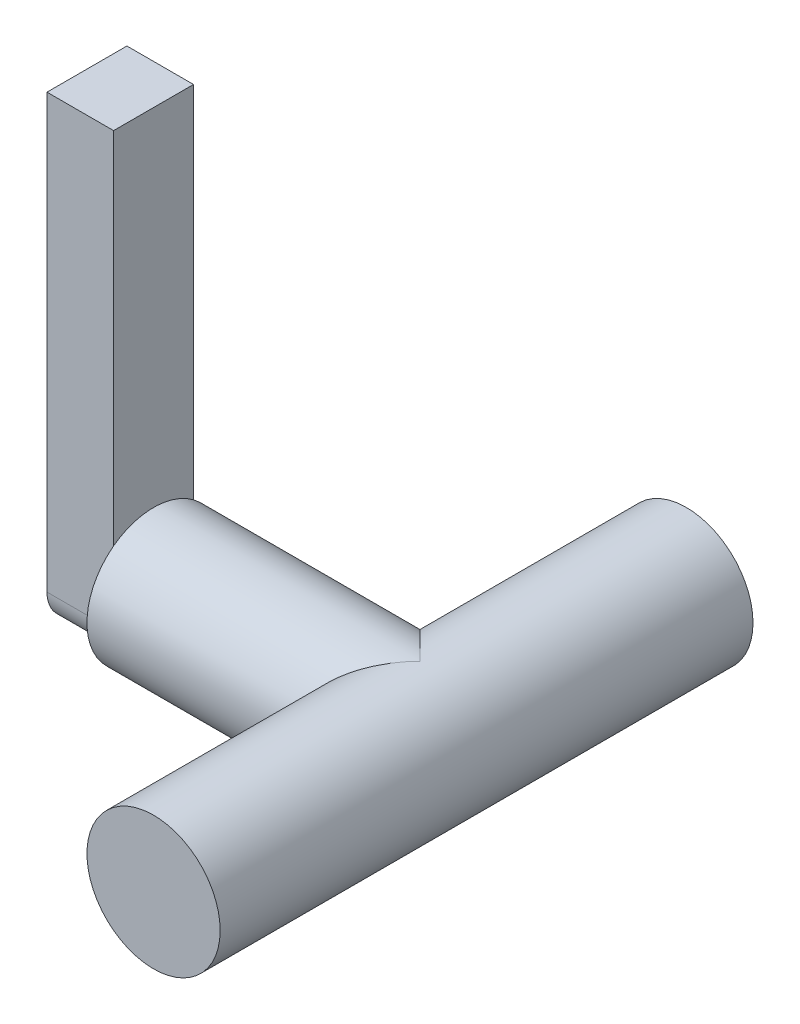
ISO-10303-21;
HEADER;
FILE_DESCRIPTION(('STEP AP214'),'2;1');
FILE_NAME('part.step','',(''),(''),'','','');
FILE_SCHEMA(('AUTOMOTIVE_DESIGN { 1 0 10303 214 1 1 1 1 }'));
ENDSEC;
DATA;
#1=APPLICATION_CONTEXT('core data for automotive mechanical design processes');
#2=APPLICATION_PROTOCOL_DEFINITION('international standard','automotive_design',2000,#1);
#3=PRODUCT_CONTEXT('',#1,'mechanical');
#4=PRODUCT('Part','Part','',(#3));
#5=PRODUCT_RELATED_PRODUCT_CATEGORY('part','',(#4));
#6=PRODUCT_DEFINITION_FORMATION('','',#4);
#7=PRODUCT_DEFINITION_CONTEXT('part definition',#1,'design');
#8=PRODUCT_DEFINITION('design','',#6,#7);
#9=PRODUCT_DEFINITION_SHAPE('','',#8);
#10=(LENGTH_UNIT() NAMED_UNIT(*) SI_UNIT(.MILLI.,.METRE.));
#11=(NAMED_UNIT(*) PLANE_ANGLE_UNIT() SI_UNIT($,.RADIAN.));
#12=(NAMED_UNIT(*) SI_UNIT($,.STERADIAN.) SOLID_ANGLE_UNIT());
#13=UNCERTAINTY_MEASURE_WITH_UNIT(LENGTH_MEASURE(1.E-05),#10,'distance_accuracy_value','');
#14=(GEOMETRIC_REPRESENTATION_CONTEXT(3) GLOBAL_UNCERTAINTY_ASSIGNED_CONTEXT((#13)) GLOBAL_UNIT_ASSIGNED_CONTEXT((#10,
#11,#12)) REPRESENTATION_CONTEXT('',''));
#15=CARTESIAN_POINT('',(0.,0.,0.));
#16=DIRECTION('',(0.,0.,1.));
#17=DIRECTION('',(1.,0.,0.));
#18=AXIS2_PLACEMENT_3D('',#15,#16,#17);
#19=CARTESIAN_POINT('',(-82.55,50.8,25.4));
#20=DIRECTION('',(1.,0.,0.));
#21=DIRECTION('',(0.,0.,-1.));
#22=AXIS2_PLACEMENT_3D('',#19,#20,#21);
#23=PLANE('',#22);
#24=DIRECTION('',(0.,1.,0.));
#25=VECTOR('',#24,1.);
#26=CARTESIAN_POINT('',(-82.55,45.72,29.21));
#27=LINE('',#26,#25);
#28=CARTESIAN_POINT('',(-82.55,48.895,29.21));
#29=VERTEX_POINT('',#28);
#30=CARTESIAN_POINT('',(-82.55,55.88,29.21));
#31=VERTEX_POINT('',#30);
#32=EDGE_CURVE('E136',#29,#31,#27,.T.);
#33=ORIENTED_EDGE('',*,*,#32,.F.);
#34=CARTESIAN_POINT('',(-82.55,48.895,26.035));
#35=DIRECTION('',(1.,0.,0.));
#36=DIRECTION('',(0.,0.,-1.));
#37=AXIS2_PLACEMENT_3D('',#34,#35,#36);
#38=CIRCLE('',#37,3.175);
#39=CARTESIAN_POINT('',(-82.55,45.72,26.035));
#40=VERTEX_POINT('',#39);
#41=EDGE_CURVE('E39',#29,#40,#38,.T.);
#42=ORIENTED_EDGE('',*,*,#41,.T.);
#43=DIRECTION('',(0.,0.,1.));
#44=VECTOR('',#43,1.);
#45=CARTESIAN_POINT('',(-82.55,45.72,21.59));
#46=LINE('',#45,#44);
#47=CARTESIAN_POINT('',(-82.55,45.72,24.765));
#48=VERTEX_POINT('',#47);
#49=EDGE_CURVE('E53',#48,#40,#46,.T.);
#50=ORIENTED_EDGE('',*,*,#49,.F.);
#51=CARTESIAN_POINT('',(-82.55,48.895,24.765));
#52=DIRECTION('',(1.,0.,0.));
#53=DIRECTION('',(0.,0.,-1.));
#54=AXIS2_PLACEMENT_3D('',#51,#52,#53);
#55=CIRCLE('',#54,3.175);
#56=CARTESIAN_POINT('',(-82.55,48.895,21.59));
#57=VERTEX_POINT('',#56);
#58=EDGE_CURVE('E11',#48,#57,#55,.T.);
#59=ORIENTED_EDGE('',*,*,#58,.T.);
#60=DIRECTION('',(0.,-1.,0.));
#61=VECTOR('',#60,1.);
#62=CARTESIAN_POINT('',(-82.55,45.72,21.59));
#63=LINE('',#62,#61);
#64=CARTESIAN_POINT('',(-82.55,55.88,21.59));
#65=VERTEX_POINT('',#64);
#66=EDGE_CURVE('E46',#65,#57,#63,.T.);
#67=ORIENTED_EDGE('',*,*,#66,.F.);
#68=CARTESIAN_POINT('',(-82.55,50.8,25.4));
#69=DIRECTION('',(1.,0.,0.));
#70=DIRECTION('',(0.,0.,-1.));
#71=AXIS2_PLACEMENT_3D('',#68,#69,#70);
#72=CIRCLE('',#71,6.35);
#73=CARTESIAN_POINT('',(-82.55,45.72,21.59));
#74=VERTEX_POINT('',#73);
#75=EDGE_CURVE('E123',#74,#65,#72,.T.);
#76=ORIENTED_EDGE('',*,*,#75,.F.);
#77=CARTESIAN_POINT('',(-82.55,45.72,29.21));
#78=VERTEX_POINT('',#77);
#79=EDGE_CURVE('E187',#78,#74,#72,.T.);
#80=ORIENTED_EDGE('',*,*,#79,.F.);
#81=EDGE_CURVE('E145',#31,#78,#72,.T.);
#82=ORIENTED_EDGE('',*,*,#81,.F.);
#83=EDGE_LOOP('',(#33,#42,#50,#59,#67,#76,#80,#82));
#84=FACE_BOUND('',#83,.T.);
#85=ADVANCED_FACE('F31',(#84),#23,.F.);
#86=CARTESIAN_POINT('',(-57.1499999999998,50.8,50.8));
#87=DIRECTION('',(0.,0.,-1.));
#88=DIRECTION('',(-1.,0.,0.));
#89=AXIS2_PLACEMENT_3D('',#86,#87,#88);
#90=CYLINDRICAL_SURFACE('',#89,6.35);
#91=CARTESIAN_POINT('',(-57.1499999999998,50.8,25.4));
#92=DIRECTION('',(-0.707106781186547,0.,-0.707106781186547));
#93=DIRECTION('',(0.707106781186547,0.,-0.707106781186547));
#94=AXIS2_PLACEMENT_3D('',#91,#92,#93);
#95=ELLIPSE('',#94,8.98025612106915,6.35);
#96=CARTESIAN_POINT('',(-57.15,57.15,25.4));
#97=VERTEX_POINT('',#96);
#98=CARTESIAN_POINT('',(-57.15,44.45,25.4));
#99=VERTEX_POINT('',#98);
#100=EDGE_CURVE('E149',#97,#99,#95,.F.);
#101=ORIENTED_EDGE('',*,*,#100,.T.);
#102=CARTESIAN_POINT('',(-57.1499999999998,50.8,25.4));
#103=DIRECTION('',(0.707106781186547,0.,-0.707106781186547));
#104=DIRECTION('',(-0.707106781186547,0.,-0.707106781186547));
#105=AXIS2_PLACEMENT_3D('',#102,#103,#104);
#106=ELLIPSE('',#105,8.98025612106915,6.35);
#107=EDGE_CURVE('E154',#99,#97,#106,.T.);
#108=ORIENTED_EDGE('',*,*,#107,.T.);
#109=EDGE_LOOP('',(#101,#108));
#110=FACE_BOUND('',#109,.T.);
#111=CARTESIAN_POINT('',(-57.1499999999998,50.8,50.8));
#112=DIRECTION('',(0.,0.,1.));
#113=DIRECTION('',(1.,0.,0.));
#114=AXIS2_PLACEMENT_3D('',#111,#112,#113);
#115=CIRCLE('',#114,6.35);
#116=CARTESIAN_POINT('',(-50.7999999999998,50.8,50.8));
#117=VERTEX_POINT('',#116);
#118=EDGE_CURVE('E146',#117,#117,#115,.T.);
#119=ORIENTED_EDGE('',*,*,#118,.F.);
#120=EDGE_LOOP('',(#119));
#121=FACE_BOUND('',#120,.T.);
#122=CARTESIAN_POINT('',(-57.1499999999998,50.8,0.));
#123=DIRECTION('',(0.,0.,1.));
#124=DIRECTION('',(1.,0.,0.));
#125=AXIS2_PLACEMENT_3D('',#122,#123,#124);
#126=CIRCLE('',#125,6.35);
#127=CARTESIAN_POINT('',(-50.7999999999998,50.8,0.));
#128=VERTEX_POINT('',#127);
#129=EDGE_CURVE('E144',#128,#128,#126,.T.);
#130=ORIENTED_EDGE('',*,*,#129,.T.);
#131=EDGE_LOOP('',(#130));
#132=FACE_BOUND('',#131,.T.);
#133=ADVANCED_FACE('F202',(#110,#121,#132),#90,.T.);
#134=CARTESIAN_POINT('',(-57.1499999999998,50.8,50.8));
#135=DIRECTION('',(0.,0.,1.));
#136=DIRECTION('',(1.,0.,0.));
#137=AXIS2_PLACEMENT_3D('',#134,#135,#136);
#138=PLANE('',#137);
#139=ORIENTED_EDGE('',*,*,#118,.T.);
#140=EDGE_LOOP('',(#139));
#141=FACE_BOUND('',#140,.T.);
#142=ADVANCED_FACE('F206',(#141),#138,.T.);
#143=CARTESIAN_POINT('',(-57.1499999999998,50.8,0.));
#144=DIRECTION('',(0.,0.,1.));
#145=DIRECTION('',(1.,0.,0.));
#146=AXIS2_PLACEMENT_3D('',#143,#144,#145);
#147=PLANE('',#146);
#148=ORIENTED_EDGE('',*,*,#129,.F.);
#149=EDGE_LOOP('',(#148));
#150=FACE_BOUND('',#149,.T.);
#151=ADVANCED_FACE('F212',(#150),#147,.F.);
#152=CARTESIAN_POINT('',(-82.55,50.8,25.4));
#153=DIRECTION('',(1.,0.,0.));
#154=DIRECTION('',(0.,0.,-1.));
#155=AXIS2_PLACEMENT_3D('',#152,#153,#154);
#156=CYLINDRICAL_SURFACE('',#155,6.35);
#157=EDGE_CURVE('E141',#65,#31,#72,.T.);
#158=ORIENTED_EDGE('',*,*,#157,.T.);
#159=ORIENTED_EDGE('',*,*,#81,.T.);
#160=ORIENTED_EDGE('',*,*,#79,.T.);
#161=ORIENTED_EDGE('',*,*,#75,.T.);
#162=EDGE_LOOP('',(#158,#159,#160,#161));
#163=FACE_BOUND('',#162,.T.);
#164=ORIENTED_EDGE('',*,*,#107,.F.);
#165=ORIENTED_EDGE('',*,*,#100,.F.);
#166=EDGE_LOOP('',(#164,#165));
#167=FACE_BOUND('',#166,.T.);
#168=ADVANCED_FACE('F185',(#163,#167),#156,.T.);
#169=CARTESIAN_POINT('',(-82.55,90.17,21.59));
#170=DIRECTION('',(1.,0.,0.));
#171=DIRECTION('',(0.,0.,-1.));
#172=AXIS2_PLACEMENT_3D('',#169,#170,#171);
#173=PLANE('',#172);
#174=ORIENTED_EDGE('',*,*,#157,.F.);
#175=CARTESIAN_POINT('',(-82.55,90.17,21.59));
#176=VERTEX_POINT('',#175);
#177=EDGE_CURVE('E133',#176,#65,#63,.T.);
#178=ORIENTED_EDGE('',*,*,#177,.F.);
#179=DIRECTION('',(0.,0.,-1.));
#180=VECTOR('',#179,1.);
#181=CARTESIAN_POINT('',(-82.55,90.17,21.59));
#182=LINE('',#181,#180);
#183=CARTESIAN_POINT('',(-82.55,90.17,29.21));
#184=VERTEX_POINT('',#183);
#185=EDGE_CURVE('E138',#184,#176,#182,.T.);
#186=ORIENTED_EDGE('',*,*,#185,.F.);
#187=EDGE_CURVE('E120',#31,#184,#27,.T.);
#188=ORIENTED_EDGE('',*,*,#187,.F.);
#189=EDGE_LOOP('',(#174,#178,#186,#188));
#190=FACE_BOUND('',#189,.T.);
#191=ADVANCED_FACE('F190',(#190),#173,.T.);
#192=CARTESIAN_POINT('',(-88.9,45.72,21.59));
#193=DIRECTION('',(0.,0.,1.));
#194=DIRECTION('',(1.,0.,0.));
#195=AXIS2_PLACEMENT_3D('',#192,#193,#194);
#196=PLANE('',#195);
#197=ORIENTED_EDGE('',*,*,#66,.T.);
#198=DIRECTION('',(1.,0.,0.));
#199=VECTOR('',#198,1.);
#200=CARTESIAN_POINT('',(-88.9,48.895,21.59));
#201=LINE('',#200,#199);
#202=CARTESIAN_POINT('',(-88.9,48.895,21.59));
#203=VERTEX_POINT('',#202);
#204=EDGE_CURVE('E166',#57,#203,#201,.F.);
#205=ORIENTED_EDGE('',*,*,#204,.T.);
#206=DIRECTION('',(0.,-1.,0.));
#207=VECTOR('',#206,1.);
#208=CARTESIAN_POINT('',(-88.9,45.72,21.59));
#209=LINE('',#208,#207);
#210=CARTESIAN_POINT('',(-88.9,90.17,21.59));
#211=VERTEX_POINT('',#210);
#212=EDGE_CURVE('E139',#211,#203,#209,.T.);
#213=ORIENTED_EDGE('',*,*,#212,.F.);
#214=DIRECTION('',(1.,0.,0.));
#215=VECTOR('',#214,1.);
#216=CARTESIAN_POINT('',(-88.9,90.17,21.59));
#217=LINE('',#216,#215);
#218=EDGE_CURVE('E124',#211,#176,#217,.T.);
#219=ORIENTED_EDGE('',*,*,#218,.T.);
#220=ORIENTED_EDGE('',*,*,#177,.T.);
#221=EDGE_LOOP('',(#197,#205,#213,#219,#220));
#222=FACE_BOUND('',#221,.T.);
#223=ADVANCED_FACE('F191',(#222),#196,.F.);
#224=CARTESIAN_POINT('',(-88.9,45.72,21.59));
#225=DIRECTION('',(0.,1.,0.));
#226=DIRECTION('',(0.,0.,1.));
#227=AXIS2_PLACEMENT_3D('',#224,#225,#226);
#228=PLANE('',#227);
#229=ORIENTED_EDGE('',*,*,#49,.T.);
#230=DIRECTION('',(1.,0.,0.));
#231=VECTOR('',#230,1.);
#232=CARTESIAN_POINT('',(-88.9,45.72,26.035));
#233=LINE('',#232,#231);
#234=CARTESIAN_POINT('',(-88.9,45.72,26.035));
#235=VERTEX_POINT('',#234);
#236=EDGE_CURVE('E161',#40,#235,#233,.F.);
#237=ORIENTED_EDGE('',*,*,#236,.T.);
#238=DIRECTION('',(0.,0.,1.));
#239=VECTOR('',#238,1.);
#240=CARTESIAN_POINT('',(-88.9,45.72,21.59));
#241=LINE('',#240,#239);
#242=CARTESIAN_POINT('',(-88.9,45.72,24.765));
#243=VERTEX_POINT('',#242);
#244=EDGE_CURVE('E114',#243,#235,#241,.T.);
#245=ORIENTED_EDGE('',*,*,#244,.F.);
#246=DIRECTION('',(1.,0.,0.));
#247=VECTOR('',#246,1.);
#248=CARTESIAN_POINT('',(-88.9,45.72,24.765));
#249=LINE('',#248,#247);
#250=EDGE_CURVE('E159',#243,#48,#249,.T.);
#251=ORIENTED_EDGE('',*,*,#250,.T.);
#252=EDGE_LOOP('',(#229,#237,#245,#251));
#253=FACE_BOUND('',#252,.T.);
#254=ADVANCED_FACE('F174',(#253),#228,.F.);
#255=CARTESIAN_POINT('',(-88.9,45.72,29.21));
#256=DIRECTION('',(0.,0.,-1.));
#257=DIRECTION('',(-1.,0.,0.));
#258=AXIS2_PLACEMENT_3D('',#255,#256,#257);
#259=PLANE('',#258);
#260=DIRECTION('',(0.,1.,0.));
#261=VECTOR('',#260,1.);
#262=CARTESIAN_POINT('',(-88.9,45.72,29.21));
#263=LINE('',#262,#261);
#264=CARTESIAN_POINT('',(-88.9,48.895,29.21));
#265=VERTEX_POINT('',#264);
#266=CARTESIAN_POINT('',(-88.9,90.17,29.21));
#267=VERTEX_POINT('',#266);
#268=EDGE_CURVE('E101',#265,#267,#263,.T.);
#269=ORIENTED_EDGE('',*,*,#268,.F.);
#270=DIRECTION('',(1.,0.,0.));
#271=VECTOR('',#270,1.);
#272=CARTESIAN_POINT('',(-88.9,48.895,29.21));
#273=LINE('',#272,#271);
#274=EDGE_CURVE('E157',#265,#29,#273,.T.);
#275=ORIENTED_EDGE('',*,*,#274,.T.);
#276=ORIENTED_EDGE('',*,*,#32,.T.);
#277=ORIENTED_EDGE('',*,*,#187,.T.);
#278=DIRECTION('',(1.,0.,0.));
#279=VECTOR('',#278,1.);
#280=CARTESIAN_POINT('',(-88.9,90.17,29.21));
#281=LINE('',#280,#279);
#282=EDGE_CURVE('E117',#267,#184,#281,.T.);
#283=ORIENTED_EDGE('',*,*,#282,.F.);
#284=EDGE_LOOP('',(#269,#275,#276,#277,#283));
#285=FACE_BOUND('',#284,.T.);
#286=ADVANCED_FACE('F118',(#285),#259,.F.);
#287=CARTESIAN_POINT('',(-88.9,90.17,21.59));
#288=DIRECTION('',(0.,-1.,0.));
#289=DIRECTION('',(0.,0.,-1.));
#290=AXIS2_PLACEMENT_3D('',#287,#288,#289);
#291=PLANE('',#290);
#292=ORIENTED_EDGE('',*,*,#185,.T.);
#293=ORIENTED_EDGE('',*,*,#218,.F.);
#294=DIRECTION('',(0.,0.,-1.));
#295=VECTOR('',#294,1.);
#296=CARTESIAN_POINT('',(-88.9,90.17,21.59));
#297=LINE('',#296,#295);
#298=EDGE_CURVE('E107',#267,#211,#297,.T.);
#299=ORIENTED_EDGE('',*,*,#298,.F.);
#300=ORIENTED_EDGE('',*,*,#282,.T.);
#301=EDGE_LOOP('',(#292,#293,#299,#300));
#302=FACE_BOUND('',#301,.T.);
#303=ADVANCED_FACE('F126',(#302),#291,.F.);
#304=CARTESIAN_POINT('',(-88.9,90.17,21.59));
#305=DIRECTION('',(1.,0.,0.));
#306=DIRECTION('',(0.,0.,-1.));
#307=AXIS2_PLACEMENT_3D('',#304,#305,#306);
#308=PLANE('',#307);
#309=ORIENTED_EDGE('',*,*,#244,.T.);
#310=CARTESIAN_POINT('',(-88.9,48.895,26.035));
#311=DIRECTION('',(1.,0.,0.));
#312=DIRECTION('',(0.,0.,-1.));
#313=AXIS2_PLACEMENT_3D('',#310,#311,#312);
#314=CIRCLE('',#313,3.175);
#315=EDGE_CURVE('E110',#235,#265,#314,.F.);
#316=ORIENTED_EDGE('',*,*,#315,.T.);
#317=ORIENTED_EDGE('',*,*,#268,.T.);
#318=ORIENTED_EDGE('',*,*,#298,.T.);
#319=ORIENTED_EDGE('',*,*,#212,.T.);
#320=CARTESIAN_POINT('',(-88.9,48.895,24.765));
#321=DIRECTION('',(1.,0.,0.));
#322=DIRECTION('',(0.,0.,-1.));
#323=AXIS2_PLACEMENT_3D('',#320,#321,#322);
#324=CIRCLE('',#323,3.175);
#325=EDGE_CURVE('E163',#203,#243,#324,.F.);
#326=ORIENTED_EDGE('',*,*,#325,.T.);
#327=EDGE_LOOP('',(#309,#316,#317,#318,#319,#326));
#328=FACE_BOUND('',#327,.T.);
#329=ADVANCED_FACE('F104',(#328),#308,.F.);
#330=CARTESIAN_POINT('',(-88.9,48.895,26.035));
#331=DIRECTION('',(1.,0.,0.));
#332=DIRECTION('',(0.,0.,-1.));
#333=AXIS2_PLACEMENT_3D('',#330,#331,#332);
#334=CYLINDRICAL_SURFACE('',#333,3.175);
#335=ORIENTED_EDGE('',*,*,#315,.F.);
#336=ORIENTED_EDGE('',*,*,#236,.F.);
#337=ORIENTED_EDGE('',*,*,#41,.F.);
#338=ORIENTED_EDGE('',*,*,#274,.F.);
#339=EDGE_LOOP('',(#335,#336,#337,#338));
#340=FACE_BOUND('',#339,.T.);
#341=ADVANCED_FACE('F172',(#340),#334,.T.);
#342=CARTESIAN_POINT('',(-88.9,48.895,24.765));
#343=DIRECTION('',(1.,0.,0.));
#344=DIRECTION('',(0.,0.,-1.));
#345=AXIS2_PLACEMENT_3D('',#342,#343,#344);
#346=CYLINDRICAL_SURFACE('',#345,3.175);
#347=ORIENTED_EDGE('',*,*,#325,.F.);
#348=ORIENTED_EDGE('',*,*,#204,.F.);
#349=ORIENTED_EDGE('',*,*,#58,.F.);
#350=ORIENTED_EDGE('',*,*,#250,.F.);
#351=EDGE_LOOP('',(#347,#348,#349,#350));
#352=FACE_BOUND('',#351,.T.);
#353=ADVANCED_FACE('F33',(#352),#346,.T.);
#354=CLOSED_SHELL('',(#85,#133,#142,#151,#168,#191,#223,#254,#286,#303,#329,#341,#353));
#355=MANIFOLD_SOLID_BREP('B2',#354);
#356=ADVANCED_BREP_SHAPE_REPRESENTATION('',(#18,#355),#14);
#357=SHAPE_DEFINITION_REPRESENTATION(#9,#356);
ENDSEC;
END-ISO-10303-21;
